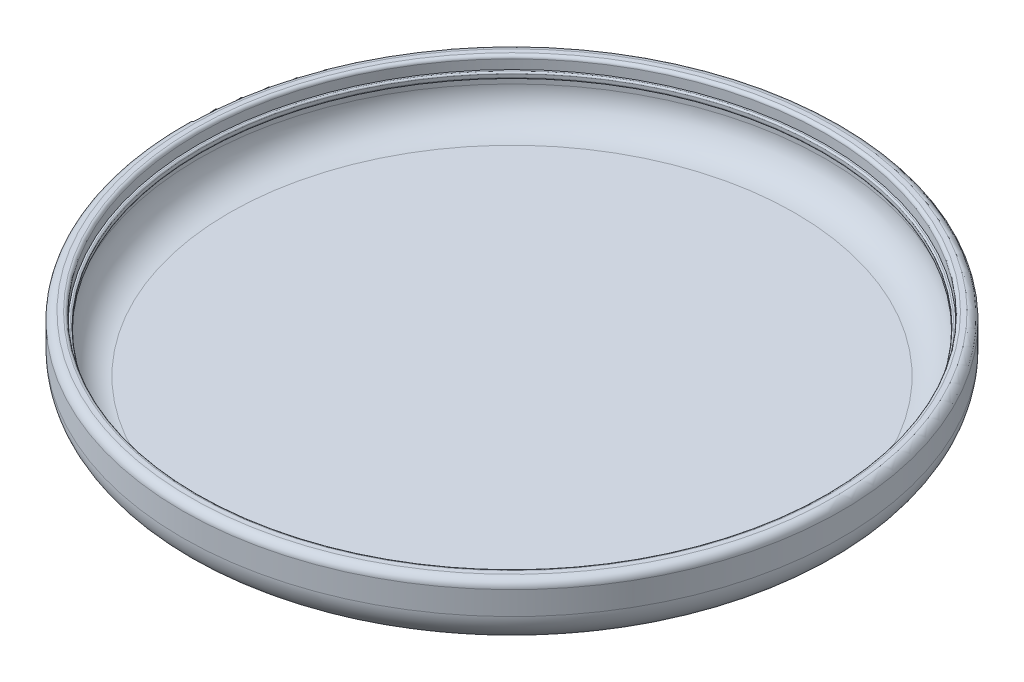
from build123d import *


with BuildPart() as part:
    # Sketch1 → Revolve1 (revolve)
    with BuildSketch(Plane(origin=(0, 0, 0), x_dir=(0, 0, -1), z_dir=(1, 0, 0))):
        with BuildLine():
            Line((52.578, 10.16), (51.816, 10.16))
            ThreePointArc((51.816, 10.16), (51.456789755, 10.011210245), (51.308, 9.652))
            Line((51.308, 9.652), (51.308, 8.128))
            Line((51.308, 8.128), (51.054, 8.128))
            ThreePointArc((51.054, 8.128), (50.874394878, 8.053605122), (50.8, 7.874))
            Line((50.8, 7.874), (50.8, 7.366))
            ThreePointArc((50.8, 7.366), (50.874394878, 7.186394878), (51.054, 7.112))
            Line((51.054, 7.112), (51.308, 7.112))
            Line((51.308, 7.112), (51.308, 6.096))
            ThreePointArc((51.308, 6.096), (49.820102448, 2.503897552), (46.228, 1.016))
            Line((46.228, 1.016), (0, 1.016))
            Line((0, 1.016), (0, 0))
            Line((0, 0), (48.768, 0))
            ThreePointArc((48.768, 0), (52.360102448, 1.487897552), (53.848, 5.08))
            Line((53.848, 5.08), (53.848, 8.89))
            ThreePointArc((53.848, 8.89), (53.476025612, 9.788025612), (52.578, 10.16))
        make_face()
    revolve(axis=Axis((0, 0, 0), (0, 1, 0)))


solid = part.part
